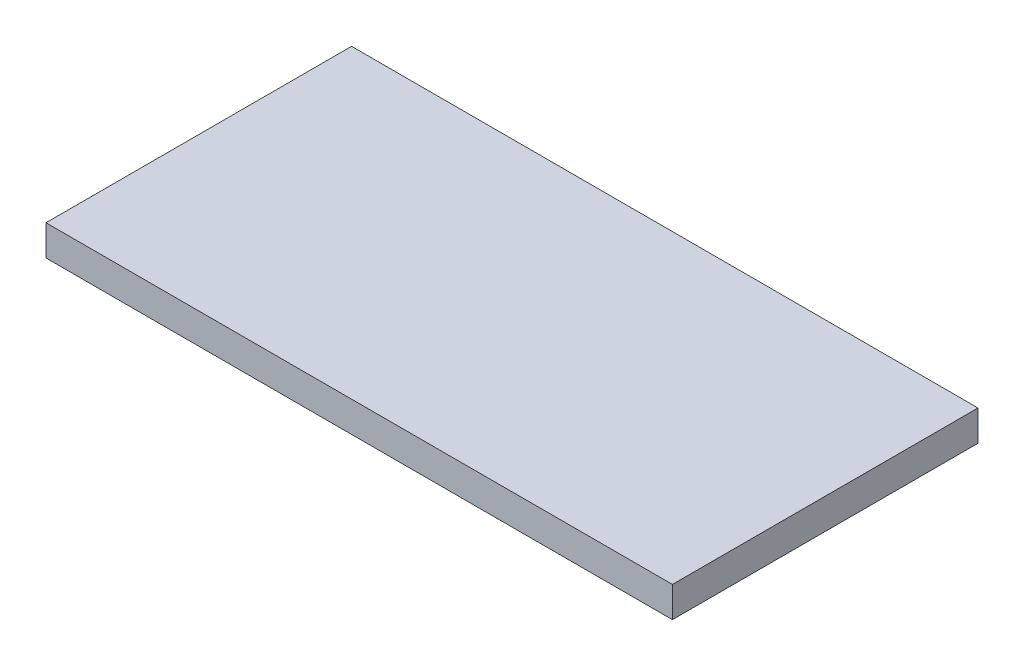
from build123d import *

# Parameters (mm, degrees)
SKIZZE1_W                       = 205
SKIZZE1_H                       = 10
AUFSATZ_LINEAR_AUSTRAGEN1_DEPTH = 50


with BuildPart() as part:
    # Skizze1 → Aufsatz-Linear austragen1 (new, symmetric)
    with BuildSketch(Plane.XY):
        with Locations((57.5, 5)):
            Rectangle(SKIZZE1_W, SKIZZE1_H)
    extrude(amount=AUFSATZ_LINEAR_AUSTRAGEN1_DEPTH, both=True)


solid = part.part
